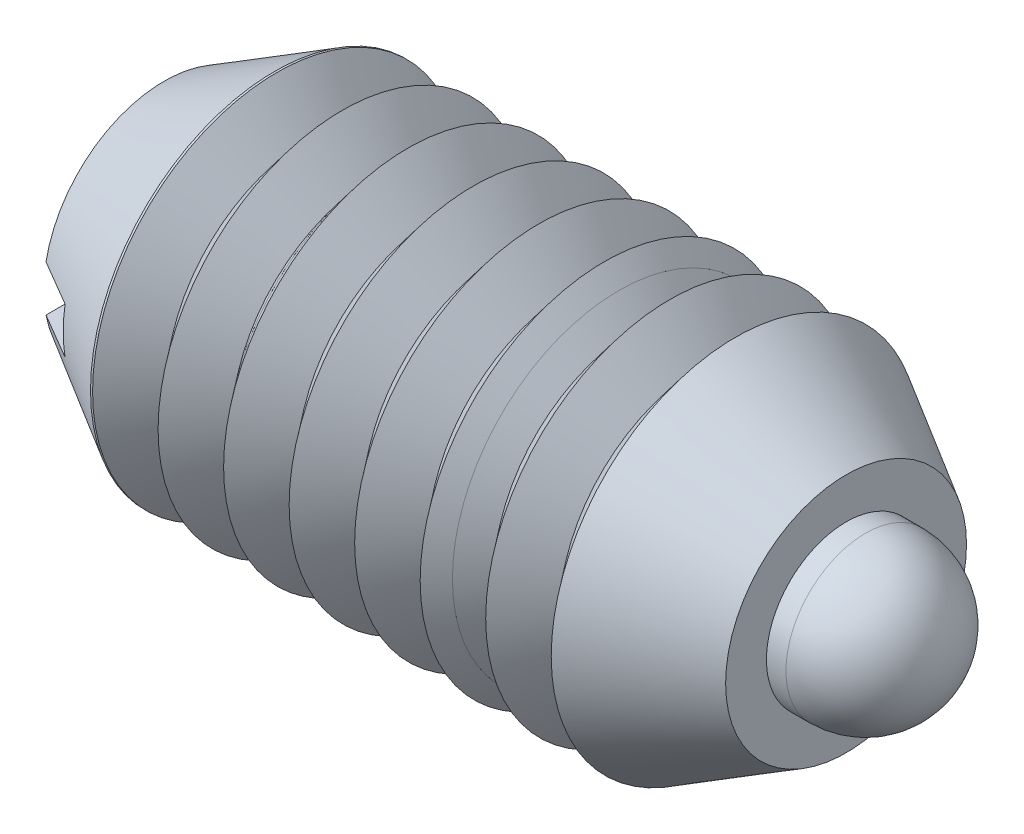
ISO-10303-21;
HEADER;
FILE_DESCRIPTION(('STEP AP214'),'2;1');
FILE_NAME('part.step','',(''),(''),'','','');
FILE_SCHEMA(('AUTOMOTIVE_DESIGN { 1 0 10303 214 1 1 1 1 }'));
ENDSEC;
DATA;
#1=APPLICATION_CONTEXT('core data for automotive mechanical design processes');
#2=APPLICATION_PROTOCOL_DEFINITION('international standard','automotive_design',2000,#1);
#3=PRODUCT_CONTEXT('',#1,'mechanical');
#4=PRODUCT('Part','Part','',(#3));
#5=PRODUCT_RELATED_PRODUCT_CATEGORY('part','',(#4));
#6=PRODUCT_DEFINITION_FORMATION('','',#4);
#7=PRODUCT_DEFINITION_CONTEXT('part definition',#1,'design');
#8=PRODUCT_DEFINITION('design','',#6,#7);
#9=PRODUCT_DEFINITION_SHAPE('','',#8);
#10=(LENGTH_UNIT() NAMED_UNIT(*) SI_UNIT(.MILLI.,.METRE.));
#11=(NAMED_UNIT(*) PLANE_ANGLE_UNIT() SI_UNIT($,.RADIAN.));
#12=(NAMED_UNIT(*) SI_UNIT($,.STERADIAN.) SOLID_ANGLE_UNIT());
#13=UNCERTAINTY_MEASURE_WITH_UNIT(LENGTH_MEASURE(1.E-05),#10,'distance_accuracy_value','');
#14=(GEOMETRIC_REPRESENTATION_CONTEXT(3) GLOBAL_UNCERTAINTY_ASSIGNED_CONTEXT((#13)) GLOBAL_UNIT_ASSIGNED_CONTEXT((#10,
#11,#12)) REPRESENTATION_CONTEXT('',''));
#15=CARTESIAN_POINT('',(0.,0.,0.));
#16=DIRECTION('',(0.,0.,1.));
#17=DIRECTION('',(1.,0.,0.));
#18=AXIS2_PLACEMENT_3D('',#15,#16,#17);
#19=CARTESIAN_POINT('',(10.741025,0.,0.));
#20=DIRECTION('',(-1.,0.,0.));
#21=DIRECTION('',(0.,-0.719424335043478,-0.694570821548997));
#22=AXIS2_PLACEMENT_3D('',#19,#20,#21);
#23=PLANE('',#22);
#24=CARTESIAN_POINT('',(10.741025,0.,0.));
#25=DIRECTION('',(1.,0.,0.));
#26=DIRECTION('',(0.,0.719424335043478,0.694570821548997));
#27=AXIS2_PLACEMENT_3D('',#24,#25,#26);
#28=CIRCLE('',#27,1.7145);
#29=CARTESIAN_POINT('',(10.741025,1.23345302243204,1.19084167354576));
#30=VERTEX_POINT('',#29);
#31=EDGE_CURVE('P0_E10',#30,#30,#28,.T.);
#32=ORIENTED_EDGE('',*,*,#31,.F.);
#33=EDGE_LOOP('',(#32));
#34=FACE_BOUND('',#33,.T.);
#35=ADVANCED_FACE('P0_F14',(#34),#23,.T.);
#36=CARTESIAN_POINT('',(11.083925,0.,0.));
#37=DIRECTION('',(1.,0.,0.));
#38=DIRECTION('',(0.,0.719424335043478,0.694570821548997));
#39=AXIS2_PLACEMENT_3D('',#36,#37,#38);
#40=CONICAL_SURFACE('',#39,2.0574,0.785398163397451);
#41=ORIENTED_EDGE('',*,*,#31,.T.);
#42=EDGE_LOOP('',(#41));
#43=FACE_BOUND('',#42,.T.);
#44=CARTESIAN_POINT('',(11.083925,0.,0.));
#45=DIRECTION('',(1.,0.,0.));
#46=DIRECTION('',(0.,0.719424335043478,0.694570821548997));
#47=AXIS2_PLACEMENT_3D('',#44,#45,#46);
#48=CIRCLE('',#47,2.0574);
#49=CARTESIAN_POINT('',(11.083925,1.48014362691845,1.42901000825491));
#50=VERTEX_POINT('',#49);
#51=EDGE_CURVE('P0_E20',#50,#50,#48,.T.);
#52=ORIENTED_EDGE('',*,*,#51,.F.);
#53=EDGE_LOOP('',(#52));
#54=FACE_BOUND('',#53,.T.);
#55=ADVANCED_FACE('P0_F54',(#43,#54),#40,.T.);
#56=CARTESIAN_POINT('',(16.817975,0.,0.));
#57=DIRECTION('',(1.,0.,0.));
#58=DIRECTION('',(0.,0.719424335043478,0.694570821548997));
#59=AXIS2_PLACEMENT_3D('',#56,#57,#58);
#60=CYLINDRICAL_SURFACE('',#59,2.0574);
#61=ORIENTED_EDGE('',*,*,#51,.T.);
#62=EDGE_LOOP('',(#61));
#63=FACE_BOUND('',#62,.T.);
#64=CARTESIAN_POINT('',(13.5761047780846,0.,0.));
#65=DIRECTION('',(1.,0.,0.));
#66=DIRECTION('',(0.,0.719424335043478,0.694570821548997));
#67=AXIS2_PLACEMENT_3D('',#64,#65,#66);
#68=CIRCLE('',#67,2.0574);
#69=CARTESIAN_POINT('',(13.5761047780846,1.48014362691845,1.42901000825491));
#70=VERTEX_POINT('',#69);
#71=EDGE_CURVE('P0_E24',#70,#70,#68,.T.);
#72=ORIENTED_EDGE('',*,*,#71,.F.);
#73=EDGE_LOOP('',(#72));
#74=FACE_BOUND('',#73,.T.);
#75=ADVANCED_FACE('P0_F50',(#63,#74),#60,.T.);
#76=CARTESIAN_POINT('',(14.170025,0.,0.));
#77=DIRECTION('',(-1.,0.,0.));
#78=DIRECTION('',(0.,-0.719424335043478,-0.694570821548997));
#79=AXIS2_PLACEMENT_3D('',#76,#77,#78);
#80=CONICAL_SURFACE('',#79,1.7145,0.5235987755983);
#81=ORIENTED_EDGE('',*,*,#71,.T.);
#82=EDGE_LOOP('',(#81));
#83=FACE_BOUND('',#82,.T.);
#84=CARTESIAN_POINT('',(14.170025,0.,0.));
#85=DIRECTION('',(1.,0.,0.));
#86=DIRECTION('',(0.,0.719424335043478,0.694570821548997));
#87=AXIS2_PLACEMENT_3D('',#84,#85,#86);
#88=CIRCLE('',#87,1.7145);
#89=CARTESIAN_POINT('',(14.170025,1.23345302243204,1.19084167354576));
#90=VERTEX_POINT('',#89);
#91=EDGE_CURVE('P0_E28',#90,#90,#88,.T.);
#92=ORIENTED_EDGE('',*,*,#91,.F.);
#93=EDGE_LOOP('',(#92));
#94=FACE_BOUND('',#93,.T.);
#95=ADVANCED_FACE('P0_F41',(#83,#94),#80,.T.);
#96=CARTESIAN_POINT('',(16.817975,0.,0.));
#97=DIRECTION('',(1.,0.,0.));
#98=DIRECTION('',(0.,0.719424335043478,0.694570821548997));
#99=AXIS2_PLACEMENT_3D('',#96,#97,#98);
#100=CYLINDRICAL_SURFACE('',#99,1.7145);
#101=ORIENTED_EDGE('',*,*,#91,.T.);
#102=EDGE_LOOP('',(#101));
#103=FACE_BOUND('',#102,.T.);
#104=CARTESIAN_POINT('',(15.103475,0.,0.));
#105=DIRECTION('',(1.,0.,0.));
#106=DIRECTION('',(0.,0.719424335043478,0.694570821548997));
#107=AXIS2_PLACEMENT_3D('',#104,#105,#106);
#108=CIRCLE('',#107,1.7145);
#109=CARTESIAN_POINT('',(15.103475,1.23345302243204,1.19084167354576));
#110=VERTEX_POINT('',#109);
#111=EDGE_CURVE('P0_E33',#110,#110,#108,.T.);
#112=ORIENTED_EDGE('',*,*,#111,.F.);
#113=EDGE_LOOP('',(#112));
#114=FACE_BOUND('',#113,.T.);
#115=ADVANCED_FACE('P0_F39',(#103,#114),#100,.T.);
#116=CARTESIAN_POINT('',(15.103475,0.,0.));
#117=DIRECTION('',(1.,0.,0.));
#118=DIRECTION('',(0.,0.719424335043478,0.694570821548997));
#119=AXIS2_PLACEMENT_3D('',#116,#117,#118);
#120=SPHERICAL_SURFACE('',#119,1.7145);
#121=ORIENTED_EDGE('',*,*,#111,.T.);
#122=EDGE_LOOP('',(#121));
#123=FACE_BOUND('',#122,.T.);
#124=ADVANCED_FACE('P0_F37',(#123),#120,.T.);
#125=CLOSED_SHELL('',(#35,#55,#75,#95,#115,#124));
#126=MANIFOLD_SOLID_BREP('P0_B1',#125);
#127=CARTESIAN_POINT('',(4.89479166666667,7.9375,-3.96875));
#128=DIRECTION('',(-1.,0.,0.));
#129=DIRECTION('',(0.,-1.,0.));
#130=AXIS2_PLACEMENT_3D('',#127,#128,#129);
#131=PLANE('',#130);
#132=CARTESIAN_POINT('',(4.89479166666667,0.,0.));
#133=DIRECTION('',(-1.,0.,0.));
#134=DIRECTION('',(0.,-1.,0.));
#135=AXIS2_PLACEMENT_3D('',#132,#133,#134);
#136=CIRCLE('',#135,3.52813069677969);
#137=CARTESIAN_POINT('',(4.89479166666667,-3.52813069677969,0.));
#138=VERTEX_POINT('',#137);
#139=EDGE_CURVE('P1_E31',#138,#138,#136,.F.);
#140=ORIENTED_EDGE('',*,*,#139,.F.);
#141=EDGE_LOOP('',(#140));
#142=FACE_BOUND('',#141,.T.);
#143=CARTESIAN_POINT('',(4.89479166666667,0.,0.));
#144=DIRECTION('',(1.,0.,0.));
#145=DIRECTION('',(0.,0.,-1.));
#146=AXIS2_PLACEMENT_3D('',#143,#144,#145);
#147=CIRCLE('',#146,2.0828);
#148=CARTESIAN_POINT('',(4.89479166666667,0.,-2.0828));
#149=VERTEX_POINT('',#148);
#150=EDGE_CURVE('P1_E47',#149,#149,#147,.T.);
#151=ORIENTED_EDGE('',*,*,#150,.T.);
#152=EDGE_LOOP('',(#151));
#153=FACE_BOUND('',#152,.T.);
#154=ADVANCED_FACE('P1_F14',(#142,#153),#131,.T.);
#155=CARTESIAN_POINT('',(9.78958333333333,7.9375,-3.96875));
#156=DIRECTION('',(1.,0.,0.));
#157=DIRECTION('',(0.,1.,0.));
#158=AXIS2_PLACEMENT_3D('',#155,#156,#157);
#159=PLANE('',#158);
#160=CARTESIAN_POINT('',(9.78958333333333,0.,0.));
#161=DIRECTION('',(1.,0.,0.));
#162=DIRECTION('',(0.,1.,0.));
#163=AXIS2_PLACEMENT_3D('',#160,#161,#162);
#164=CIRCLE('',#163,3.58320810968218);
#165=CARTESIAN_POINT('',(9.78958333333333,3.58320810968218,0.));
#166=VERTEX_POINT('',#165);
#167=EDGE_CURVE('P1_E33',#166,#166,#164,.F.);
#168=ORIENTED_EDGE('',*,*,#167,.F.);
#169=EDGE_LOOP('',(#168));
#170=FACE_BOUND('',#169,.T.);
#171=CARTESIAN_POINT('',(9.78958333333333,0.,0.));
#172=DIRECTION('',(1.,0.,0.));
#173=DIRECTION('',(0.,1.,0.));
#174=AXIS2_PLACEMENT_3D('',#171,#172,#173);
#175=CIRCLE('',#174,2.0828);
#176=CARTESIAN_POINT('',(9.78958333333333,2.0828,0.));
#177=VERTEX_POINT('',#176);
#178=EDGE_CURVE('P1_E18',#177,#177,#175,.F.);
#179=ORIENTED_EDGE('',*,*,#178,.T.);
#180=EDGE_LOOP('',(#179));
#181=FACE_BOUND('',#180,.T.);
#182=ADVANCED_FACE('P1_F76',(#170,#181),#159,.T.);
#183=CARTESIAN_POINT('',(6.65868055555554,0.,0.));
#184=DIRECTION('',(-1.,0.,0.));
#185=DIRECTION('',(0.,0.,1.));
#186=AXIS2_PLACEMENT_3D('',#183,#184,#185);
#187=CONICAL_SURFACE('',#186,3.96875,0.89566479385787);
#188=CARTESIAN_POINT('',(7.36423611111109,0.,0.));
#189=DIRECTION('',(-1.,0.,0.));
#190=DIRECTION('',(0.,0.,1.));
#191=AXIS2_PLACEMENT_3D('',#188,#189,#190);
#192=CIRCLE('',#191,3.08751139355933);
#193=CARTESIAN_POINT('',(7.36423611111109,0.,3.08751139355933));
#194=VERTEX_POINT('',#193);
#195=EDGE_CURVE('P1_E27',#194,#194,#192,.T.);
#196=ORIENTED_EDGE('',*,*,#195,.T.);
#197=EDGE_LOOP('',(#196));
#198=FACE_BOUND('',#197,.T.);
#199=CARTESIAN_POINT('',(6.65868055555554,0.,0.));
#200=DIRECTION('',(-1.,0.,0.));
#201=DIRECTION('',(0.,0.,1.));
#202=AXIS2_PLACEMENT_3D('',#199,#200,#201);
#203=CIRCLE('',#202,3.96875);
#204=CARTESIAN_POINT('',(6.65868055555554,0.,3.96875));
#205=VERTEX_POINT('',#204);
#206=EDGE_CURVE('P1_E39',#205,#205,#203,.T.);
#207=ORIENTED_EDGE('',*,*,#206,.F.);
#208=EDGE_LOOP('',(#207));
#209=FACE_BOUND('',#208,.T.);
#210=ADVANCED_FACE('P1_F56',(#198,#209),#187,.T.);
#211=CARTESIAN_POINT('',(5.95312499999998,0.,0.));
#212=DIRECTION('',(1.,0.,0.));
#213=DIRECTION('',(0.,0.,-1.));
#214=AXIS2_PLACEMENT_3D('',#211,#212,#213);
#215=CONICAL_SURFACE('',#214,3.08751139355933,0.895664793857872);
#216=ORIENTED_EDGE('',*,*,#206,.T.);
#217=EDGE_LOOP('',(#216));
#218=FACE_BOUND('',#217,.T.);
#219=CARTESIAN_POINT('',(5.95312499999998,0.,0.));
#220=DIRECTION('',(-1.,0.,0.));
#221=DIRECTION('',(0.,0.,1.));
#222=AXIS2_PLACEMENT_3D('',#219,#220,#221);
#223=CIRCLE('',#222,3.08751139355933);
#224=CARTESIAN_POINT('',(5.95312499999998,0.,3.08751139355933));
#225=VERTEX_POINT('',#224);
#226=EDGE_CURVE('P1_E44',#225,#225,#223,.T.);
#227=ORIENTED_EDGE('',*,*,#226,.F.);
#228=EDGE_LOOP('',(#227));
#229=FACE_BOUND('',#228,.T.);
#230=ADVANCED_FACE('P1_F90',(#218,#229),#215,.T.);
#231=CARTESIAN_POINT('',(5.24756944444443,0.,0.));
#232=DIRECTION('',(-1.,0.,0.));
#233=DIRECTION('',(0.,0.,1.));
#234=AXIS2_PLACEMENT_3D('',#231,#232,#233);
#235=CONICAL_SURFACE('',#234,3.96875,0.89566479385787);
#236=ORIENTED_EDGE('',*,*,#226,.T.);
#237=EDGE_LOOP('',(#236));
#238=FACE_BOUND('',#237,.T.);
#239=CARTESIAN_POINT('',(5.24756944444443,0.,0.));
#240=DIRECTION('',(-1.,0.,0.));
#241=DIRECTION('',(0.,0.,1.));
#242=AXIS2_PLACEMENT_3D('',#239,#240,#241);
#243=CIRCLE('',#242,3.96875);
#244=CARTESIAN_POINT('',(5.24756944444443,0.,3.96875));
#245=VERTEX_POINT('',#244);
#246=EDGE_CURVE('P1_E35',#245,#245,#243,.T.);
#247=ORIENTED_EDGE('',*,*,#246,.F.);
#248=EDGE_LOOP('',(#247));
#249=FACE_BOUND('',#248,.T.);
#250=ADVANCED_FACE('P1_F72',(#238,#249),#235,.T.);
#251=CARTESIAN_POINT('',(4.54201388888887,0.,0.));
#252=DIRECTION('',(1.,0.,0.));
#253=DIRECTION('',(0.,0.,-1.));
#254=AXIS2_PLACEMENT_3D('',#251,#252,#253);
#255=CONICAL_SURFACE('',#254,3.08751139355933,0.895664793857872);
#256=ORIENTED_EDGE('',*,*,#246,.T.);
#257=EDGE_LOOP('',(#256));
#258=FACE_BOUND('',#257,.T.);
#259=ORIENTED_EDGE('',*,*,#139,.T.);
#260=EDGE_LOOP('',(#259));
#261=FACE_BOUND('',#260,.T.);
#262=ADVANCED_FACE('P1_F62',(#258,#261),#255,.T.);
#263=CARTESIAN_POINT('',(7.36423611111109,0.,0.));
#264=DIRECTION('',(1.,0.,0.));
#265=DIRECTION('',(0.,0.,-1.));
#266=AXIS2_PLACEMENT_3D('',#263,#264,#265);
#267=CONICAL_SURFACE('',#266,3.08751139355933,0.895664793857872);
#268=CARTESIAN_POINT('',(8.06979166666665,0.,0.));
#269=DIRECTION('',(-1.,0.,0.));
#270=DIRECTION('',(0.,0.,1.));
#271=AXIS2_PLACEMENT_3D('',#268,#269,#270);
#272=CIRCLE('',#271,3.96875);
#273=CARTESIAN_POINT('',(8.06979166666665,0.,3.96875));
#274=VERTEX_POINT('',#273);
#275=EDGE_CURVE('P1_E51',#274,#274,#272,.T.);
#276=ORIENTED_EDGE('',*,*,#275,.T.);
#277=EDGE_LOOP('',(#276));
#278=FACE_BOUND('',#277,.T.);
#279=ORIENTED_EDGE('',*,*,#195,.F.);
#280=EDGE_LOOP('',(#279));
#281=FACE_BOUND('',#280,.T.);
#282=ADVANCED_FACE('P1_F59',(#278,#281),#267,.T.);
#283=CARTESIAN_POINT('',(8.06979166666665,0.,0.));
#284=DIRECTION('',(-1.,0.,0.));
#285=DIRECTION('',(0.,0.,1.));
#286=AXIS2_PLACEMENT_3D('',#283,#284,#285);
#287=CONICAL_SURFACE('',#286,3.96875,0.89566479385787);
#288=CARTESIAN_POINT('',(8.77534722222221,0.,0.));
#289=DIRECTION('',(-1.,0.,0.));
#290=DIRECTION('',(0.,0.,1.));
#291=AXIS2_PLACEMENT_3D('',#288,#289,#290);
#292=CIRCLE('',#291,3.08751139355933);
#293=CARTESIAN_POINT('',(8.77534722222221,0.,3.08751139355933));
#294=VERTEX_POINT('',#293);
#295=EDGE_CURVE('P1_E10',#294,#294,#292,.T.);
#296=ORIENTED_EDGE('',*,*,#295,.T.);
#297=EDGE_LOOP('',(#296));
#298=FACE_BOUND('',#297,.T.);
#299=ORIENTED_EDGE('',*,*,#275,.F.);
#300=EDGE_LOOP('',(#299));
#301=FACE_BOUND('',#300,.T.);
#302=ADVANCED_FACE('P1_F61',(#298,#301),#287,.T.);
#303=CARTESIAN_POINT('',(8.77534722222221,0.,0.));
#304=DIRECTION('',(1.,0.,0.));
#305=DIRECTION('',(0.,0.,-1.));
#306=AXIS2_PLACEMENT_3D('',#303,#304,#305);
#307=CONICAL_SURFACE('',#306,3.08751139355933,0.895664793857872);
#308=CARTESIAN_POINT('',(9.48090277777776,0.,0.));
#309=DIRECTION('',(-1.,0.,0.));
#310=DIRECTION('',(0.,0.,1.));
#311=AXIS2_PLACEMENT_3D('',#308,#309,#310);
#312=CIRCLE('',#311,3.96875);
#313=CARTESIAN_POINT('',(9.48090277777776,0.,3.96875));
#314=VERTEX_POINT('',#313);
#315=EDGE_CURVE('P1_E22',#314,#314,#312,.T.);
#316=ORIENTED_EDGE('',*,*,#315,.T.);
#317=EDGE_LOOP('',(#316));
#318=FACE_BOUND('',#317,.T.);
#319=ORIENTED_EDGE('',*,*,#295,.F.);
#320=EDGE_LOOP('',(#319));
#321=FACE_BOUND('',#320,.T.);
#322=ADVANCED_FACE('P1_F70',(#318,#321),#307,.T.);
#323=CARTESIAN_POINT('',(9.48090277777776,0.,0.));
#324=DIRECTION('',(-1.,0.,0.));
#325=DIRECTION('',(0.,0.,1.));
#326=AXIS2_PLACEMENT_3D('',#323,#324,#325);
#327=CONICAL_SURFACE('',#326,3.96875,0.89566479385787);
#328=ORIENTED_EDGE('',*,*,#315,.F.);
#329=EDGE_LOOP('',(#328));
#330=FACE_BOUND('',#329,.T.);
#331=ORIENTED_EDGE('',*,*,#167,.T.);
#332=EDGE_LOOP('',(#331));
#333=FACE_BOUND('',#332,.T.);
#334=ADVANCED_FACE('P1_F16',(#330,#333),#327,.T.);
#335=CARTESIAN_POINT('',(14.684375,0.,0.));
#336=DIRECTION('',(-1.,0.,0.));
#337=DIRECTION('',(0.,0.,1.));
#338=AXIS2_PLACEMENT_3D('',#335,#336,#337);
#339=CYLINDRICAL_SURFACE('',#338,2.0828);
#340=ORIENTED_EDGE('',*,*,#178,.F.);
#341=EDGE_LOOP('',(#340));
#342=FACE_BOUND('',#341,.T.);
#343=ORIENTED_EDGE('',*,*,#150,.F.);
#344=EDGE_LOOP('',(#343));
#345=FACE_BOUND('',#344,.T.);
#346=ADVANCED_FACE('P1_F147',(#342,#345),#339,.F.);
#347=CLOSED_SHELL('',(#154,#182,#210,#230,#250,#262,#282,#302,#322,#334,#346));
#348=MANIFOLD_SOLID_BREP('P1_B1',#347);
#349=CARTESIAN_POINT('',(14.684375,0.,0.));
#350=DIRECTION('',(1.,0.,0.));
#351=DIRECTION('',(0.,0.,-1.));
#352=AXIS2_PLACEMENT_3D('',#349,#350,#351);
#353=PLANE('',#352);
#354=CARTESIAN_POINT('',(14.684375,0.,0.));
#355=DIRECTION('',(1.,0.,0.));
#356=DIRECTION('',(0.,0.,-1.));
#357=AXIS2_PLACEMENT_3D('',#354,#355,#356);
#358=CIRCLE('',#357,2.5939346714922);
#359=CARTESIAN_POINT('',(14.684375,0.,-2.5939346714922));
#360=VERTEX_POINT('',#359);
#361=EDGE_CURVE('P2_E79',#360,#360,#358,.T.);
#362=ORIENTED_EDGE('',*,*,#361,.T.);
#363=EDGE_LOOP('',(#362));
#364=FACE_BOUND('',#363,.T.);
#365=CARTESIAN_POINT('',(14.684375,0.,0.));
#366=DIRECTION('',(-1.,0.,0.));
#367=DIRECTION('',(0.,0.,1.));
#368=AXIS2_PLACEMENT_3D('',#365,#366,#367);
#369=CIRCLE('',#368,1.7145);
#370=CARTESIAN_POINT('',(14.684375,0.,1.7145));
#371=VERTEX_POINT('',#370);
#372=EDGE_CURVE('P2_E66',#371,#371,#369,.T.);
#373=ORIENTED_EDGE('',*,*,#372,.T.);
#374=EDGE_LOOP('',(#373));
#375=FACE_BOUND('',#374,.T.);
#376=ADVANCED_FACE('P2_F15',(#364,#375),#353,.T.);
#377=CARTESIAN_POINT('',(14.684375,0.,0.));
#378=DIRECTION('',(-1.,0.,0.));
#379=DIRECTION('',(0.,0.,1.));
#380=AXIS2_PLACEMENT_3D('',#377,#378,#379);
#381=CONICAL_SURFACE('',#380,2.5939346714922,0.523598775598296);
#382=CARTESIAN_POINT('',(12.303125,0.,0.));
#383=DIRECTION('',(-1.,0.,0.));
#384=DIRECTION('',(0.,0.,1.));
#385=AXIS2_PLACEMENT_3D('',#382,#383,#384);
#386=CIRCLE('',#385,3.96875);
#387=CARTESIAN_POINT('',(12.303125,0.,3.96875));
#388=VERTEX_POINT('',#387);
#389=EDGE_CURVE('P2_E142',#388,#388,#386,.T.);
#390=ORIENTED_EDGE('',*,*,#389,.F.);
#391=EDGE_LOOP('',(#390));
#392=FACE_BOUND('',#391,.T.);
#393=ORIENTED_EDGE('',*,*,#361,.F.);
#394=EDGE_LOOP('',(#393));
#395=FACE_BOUND('',#394,.T.);
#396=ADVANCED_FACE('P2_F17',(#392,#395),#381,.T.);
#397=CARTESIAN_POINT('',(0.,0.,0.));
#398=DIRECTION('',(-1.,0.,0.));
#399=DIRECTION('',(0.,0.,1.));
#400=AXIS2_PLACEMENT_3D('',#397,#398,#399);
#401=CYLINDRICAL_SURFACE('',#400,1.7145);
#402=CARTESIAN_POINT('',(14.170025,0.,0.));
#403=DIRECTION('',(-1.,0.,0.));
#404=DIRECTION('',(0.,0.,1.));
#405=AXIS2_PLACEMENT_3D('',#402,#403,#404);
#406=CIRCLE('',#405,1.7145);
#407=CARTESIAN_POINT('',(14.170025,0.,1.7145));
#408=VERTEX_POINT('',#407);
#409=EDGE_CURVE('P2_E154',#408,#408,#406,.T.);
#410=ORIENTED_EDGE('',*,*,#409,.T.);
#411=EDGE_LOOP('',(#410));
#412=FACE_BOUND('',#411,.T.);
#413=ORIENTED_EDGE('',*,*,#372,.F.);
#414=EDGE_LOOP('',(#413));
#415=FACE_BOUND('',#414,.T.);
#416=ADVANCED_FACE('P2_F180',(#412,#415),#401,.F.);
#417=CARTESIAN_POINT('',(14.170025,0.,0.));
#418=DIRECTION('',(-1.,0.,0.));
#419=DIRECTION('',(0.,0.,1.));
#420=AXIS2_PLACEMENT_3D('',#417,#418,#419);
#421=CONICAL_SURFACE('',#420,1.7145,0.785398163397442);
#422=CARTESIAN_POINT('',(13.827125,0.,0.));
#423=DIRECTION('',(-1.,0.,0.));
#424=DIRECTION('',(0.,0.,1.));
#425=AXIS2_PLACEMENT_3D('',#422,#423,#424);
#426=CIRCLE('',#425,2.0574);
#427=CARTESIAN_POINT('',(13.827125,0.,2.0574));
#428=VERTEX_POINT('',#427);
#429=EDGE_CURVE('P2_E151',#428,#428,#426,.T.);
#430=ORIENTED_EDGE('',*,*,#429,.T.);
#431=EDGE_LOOP('',(#430));
#432=FACE_BOUND('',#431,.T.);
#433=ORIENTED_EDGE('',*,*,#409,.F.);
#434=EDGE_LOOP('',(#433));
#435=FACE_BOUND('',#434,.T.);
#436=ADVANCED_FACE('P2_F187',(#432,#435),#421,.F.);
#437=CARTESIAN_POINT('',(0.,0.,0.));
#438=DIRECTION('',(-1.,0.,0.));
#439=DIRECTION('',(0.,0.,1.));
#440=AXIS2_PLACEMENT_3D('',#437,#438,#439);
#441=CYLINDRICAL_SURFACE('',#440,2.0574);
#442=CARTESIAN_POINT('',(2.9765625,0.,0.));
#443=DIRECTION('',(-1.,0.,0.));
#444=DIRECTION('',(0.,0.,1.));
#445=AXIS2_PLACEMENT_3D('',#442,#443,#444);
#446=CIRCLE('',#445,2.0574);
#447=CARTESIAN_POINT('',(2.9765625,0.,2.0574));
#448=VERTEX_POINT('',#447);
#449=EDGE_CURVE('P2_E148',#448,#448,#446,.T.);
#450=ORIENTED_EDGE('',*,*,#449,.T.);
#451=EDGE_LOOP('',(#450));
#452=FACE_BOUND('',#451,.T.);
#453=ORIENTED_EDGE('',*,*,#429,.F.);
#454=EDGE_LOOP('',(#453));
#455=FACE_BOUND('',#454,.T.);
#456=ADVANCED_FACE('P2_F192',(#452,#455),#441,.F.);
#457=CARTESIAN_POINT('',(2.9765625,0.,0.));
#458=DIRECTION('',(1.,0.,0.));
#459=DIRECTION('',(0.,0.,-1.));
#460=AXIS2_PLACEMENT_3D('',#457,#458,#459);
#461=PLANE('',#460);
#462=ORIENTED_EDGE('',*,*,#449,.F.);
#463=EDGE_LOOP('',(#462));
#464=FACE_BOUND('',#463,.T.);
#465=ADVANCED_FACE('P2_F198',(#464),#461,.T.);
#466=CARTESIAN_POINT('',(11.5975694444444,0.,0.));
#467=DIRECTION('',(1.,0.,0.));
#468=DIRECTION('',(0.,0.,-1.));
#469=AXIS2_PLACEMENT_3D('',#466,#467,#468);
#470=CONICAL_SURFACE('',#469,3.08751139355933,0.895664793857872);
#471=ORIENTED_EDGE('',*,*,#389,.T.);
#472=EDGE_LOOP('',(#471));
#473=FACE_BOUND('',#472,.T.);
#474=CARTESIAN_POINT('',(11.5975694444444,0.,0.));
#475=DIRECTION('',(-1.,0.,0.));
#476=DIRECTION('',(0.,0.,1.));
#477=AXIS2_PLACEMENT_3D('',#474,#475,#476);
#478=CIRCLE('',#477,3.08751139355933);
#479=CARTESIAN_POINT('',(11.5975694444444,0.,3.08751139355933));
#480=VERTEX_POINT('',#479);
#481=EDGE_CURVE('P2_E145',#480,#480,#478,.T.);
#482=ORIENTED_EDGE('',*,*,#481,.F.);
#483=EDGE_LOOP('',(#482));
#484=FACE_BOUND('',#483,.T.);
#485=ADVANCED_FACE('P2_F202',(#473,#484),#470,.T.);
#486=CARTESIAN_POINT('',(10.8920138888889,0.,0.));
#487=DIRECTION('',(-1.,0.,0.));
#488=DIRECTION('',(0.,0.,1.));
#489=AXIS2_PLACEMENT_3D('',#486,#487,#488);
#490=CONICAL_SURFACE('',#489,3.96875,0.89566479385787);
#491=ORIENTED_EDGE('',*,*,#481,.T.);
#492=EDGE_LOOP('',(#491));
#493=FACE_BOUND('',#492,.T.);
#494=CARTESIAN_POINT('',(10.8920138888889,0.,0.));
#495=DIRECTION('',(-1.,0.,0.));
#496=DIRECTION('',(0.,0.,1.));
#497=AXIS2_PLACEMENT_3D('',#494,#495,#496);
#498=CIRCLE('',#497,3.96875);
#499=CARTESIAN_POINT('',(10.8920138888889,0.,3.96875));
#500=VERTEX_POINT('',#499);
#501=EDGE_CURVE('P2_E136',#500,#500,#498,.T.);
#502=ORIENTED_EDGE('',*,*,#501,.F.);
#503=EDGE_LOOP('',(#502));
#504=FACE_BOUND('',#503,.T.);
#505=ADVANCED_FACE('P2_F206',(#493,#504),#490,.T.);
#506=CARTESIAN_POINT('',(10.1864583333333,0.,0.));
#507=DIRECTION('',(1.,0.,0.));
#508=DIRECTION('',(0.,0.,-1.));
#509=AXIS2_PLACEMENT_3D('',#506,#507,#508);
#510=CONICAL_SURFACE('',#509,3.08751139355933,0.895664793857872);
#511=ORIENTED_EDGE('',*,*,#501,.T.);
#512=EDGE_LOOP('',(#511));
#513=FACE_BOUND('',#512,.T.);
#514=CARTESIAN_POINT('',(10.1864583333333,0.,0.));
#515=DIRECTION('',(-1.,0.,0.));
#516=DIRECTION('',(0.,0.,1.));
#517=AXIS2_PLACEMENT_3D('',#514,#515,#516);
#518=CIRCLE('',#517,3.08751139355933);
#519=CARTESIAN_POINT('',(10.1864583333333,0.,3.08751139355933));
#520=VERTEX_POINT('',#519);
#521=EDGE_CURVE('P2_E139',#520,#520,#518,.T.);
#522=ORIENTED_EDGE('',*,*,#521,.F.);
#523=EDGE_LOOP('',(#522));
#524=FACE_BOUND('',#523,.T.);
#525=ADVANCED_FACE('P2_F210',(#513,#524),#510,.T.);
#526=CARTESIAN_POINT('',(9.48090277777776,0.,0.));
#527=DIRECTION('',(-1.,0.,0.));
#528=DIRECTION('',(0.,0.,1.));
#529=AXIS2_PLACEMENT_3D('',#526,#527,#528);
#530=CONICAL_SURFACE('',#529,3.96875,0.89566479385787);
#531=CARTESIAN_POINT('',(9.78958333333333,0.,0.));
#532=DIRECTION('',(1.,0.,0.));
#533=DIRECTION('',(0.,0.,-1.));
#534=AXIS2_PLACEMENT_3D('',#531,#532,#533);
#535=CIRCLE('',#534,3.58320810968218);
#536=CARTESIAN_POINT('',(9.78958333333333,0.,-3.58320810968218));
#537=VERTEX_POINT('',#536);
#538=EDGE_CURVE('P2_E19',#537,#537,#535,.F.);
#539=ORIENTED_EDGE('',*,*,#538,.F.);
#540=EDGE_LOOP('',(#539));
#541=FACE_BOUND('',#540,.T.);
#542=ORIENTED_EDGE('',*,*,#521,.T.);
#543=EDGE_LOOP('',(#542));
#544=FACE_BOUND('',#543,.T.);
#545=ADVANCED_FACE('P2_F214',(#541,#544),#530,.T.);
#546=CARTESIAN_POINT('',(4.89479166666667,0.,0.));
#547=DIRECTION('',(1.,0.,0.));
#548=DIRECTION('',(0.,0.,-1.));
#549=AXIS2_PLACEMENT_3D('',#546,#547,#548);
#550=PLANE('',#549);
#551=CARTESIAN_POINT('',(4.89479166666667,0.,0.));
#552=DIRECTION('',(1.,0.,0.));
#553=DIRECTION('',(0.,0.,-1.));
#554=AXIS2_PLACEMENT_3D('',#551,#552,#553);
#555=CIRCLE('',#554,3.52813069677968);
#556=CARTESIAN_POINT('',(4.89479166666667,0.,-3.52813069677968));
#557=VERTEX_POINT('',#556);
#558=EDGE_CURVE('P2_E110',#557,#557,#555,.F.);
#559=ORIENTED_EDGE('',*,*,#558,.F.);
#560=EDGE_LOOP('',(#559));
#561=FACE_BOUND('',#560,.T.);
#562=CARTESIAN_POINT('',(4.89479166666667,0.,0.));
#563=DIRECTION('',(1.,0.,0.));
#564=DIRECTION('',(0.,0.,-1.));
#565=AXIS2_PLACEMENT_3D('',#562,#563,#564);
#566=CIRCLE('',#565,2.0828);
#567=CARTESIAN_POINT('',(4.89479166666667,0.,-2.0828));
#568=VERTEX_POINT('',#567);
#569=EDGE_CURVE('P2_E112',#568,#568,#566,.T.);
#570=ORIENTED_EDGE('',*,*,#569,.F.);
#571=EDGE_LOOP('',(#570));
#572=FACE_BOUND('',#571,.T.);
#573=ADVANCED_FACE('P2_F218',(#561,#572),#550,.T.);
#574=CARTESIAN_POINT('',(21.1563248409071,0.,0.));
#575=DIRECTION('',(-1.,0.,0.));
#576=DIRECTION('',(0.,0.,1.));
#577=AXIS2_PLACEMENT_3D('',#574,#575,#576);
#578=CYLINDRICAL_SURFACE('',#577,2.0828);
#579=ORIENTED_EDGE('',*,*,#569,.T.);
#580=EDGE_LOOP('',(#579));
#581=FACE_BOUND('',#580,.T.);
#582=CARTESIAN_POINT('',(9.78958333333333,0.,0.));
#583=DIRECTION('',(1.,0.,0.));
#584=DIRECTION('',(0.,0.,-1.));
#585=AXIS2_PLACEMENT_3D('',#582,#583,#584);
#586=CIRCLE('',#585,2.0828);
#587=CARTESIAN_POINT('',(9.78958333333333,0.,-2.0828));
#588=VERTEX_POINT('',#587);
#589=EDGE_CURVE('P2_E118',#588,#588,#586,.T.);
#590=ORIENTED_EDGE('',*,*,#589,.F.);
#591=EDGE_LOOP('',(#590));
#592=FACE_BOUND('',#591,.T.);
#593=ADVANCED_FACE('P2_F171',(#581,#592),#578,.T.);
#594=CARTESIAN_POINT('',(9.78958333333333,0.,0.));
#595=DIRECTION('',(1.,0.,0.));
#596=DIRECTION('',(0.,0.,-1.));
#597=AXIS2_PLACEMENT_3D('',#594,#595,#596);
#598=PLANE('',#597);
#599=ORIENTED_EDGE('',*,*,#538,.T.);
#600=EDGE_LOOP('',(#599));
#601=FACE_BOUND('',#600,.T.);
#602=ORIENTED_EDGE('',*,*,#589,.T.);
#603=EDGE_LOOP('',(#602));
#604=FACE_BOUND('',#603,.T.);
#605=ADVANCED_FACE('P2_F166',(#601,#604),#598,.F.);
#606=CARTESIAN_POINT('',(0.,0.,0.));
#607=DIRECTION('',(1.,0.,0.));
#608=DIRECTION('',(0.,0.,-1.));
#609=AXIS2_PLACEMENT_3D('',#606,#607,#608);
#610=PLANE('',#609);
#611=CARTESIAN_POINT('',(0.,0.,0.));
#612=DIRECTION('',(1.,0.,0.));
#613=DIRECTION('',(0.,0.,-1.));
#614=AXIS2_PLACEMENT_3D('',#611,#612,#613);
#615=CIRCLE('',#614,2.5939346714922);
#616=CARTESIAN_POINT('',(0.,-0.49609375,-2.5460534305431));
#617=VERTEX_POINT('',#616);
#618=CARTESIAN_POINT('',(0.,-0.49609375,2.5460534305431));
#619=VERTEX_POINT('',#618);
#620=EDGE_CURVE('P2_E75',#617,#619,#615,.F.);
#621=ORIENTED_EDGE('',*,*,#620,.T.);
#622=DIRECTION('',(0.,0.,1.));
#623=VECTOR('',#622,1.);
#624=CARTESIAN_POINT('',(0.,-0.49609375,-3.96875));
#625=LINE('',#624,#623);
#626=EDGE_CURVE('P2_E33',#617,#619,#625,.T.);
#627=ORIENTED_EDGE('',*,*,#626,.F.);
#628=EDGE_LOOP('',(#621,#627));
#629=FACE_BOUND('',#628,.T.);
#630=ADVANCED_FACE('P2_F101',(#629),#610,.F.);
#631=CARTESIAN_POINT('',(0.,-0.49609375,-3.96875));
#632=DIRECTION('',(0.,-1.,0.));
#633=DIRECTION('',(0.,0.,-1.));
#634=AXIS2_PLACEMENT_3D('',#631,#632,#633);
#635=PLANE('',#634);
#636=CARTESIAN_POINT('',(5.79195031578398,-0.49609375,-5.91715894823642));
#637=CARTESIAN_POINT('',(5.50277108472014,-0.49609375,-5.74961309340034));
#638=CARTESIAN_POINT('',(5.21361142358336,-0.49609375,-5.58203343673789));
#639=CARTESIAN_POINT('',(4.63534852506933,-0.49609375,-5.24677609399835));
#640=CARTESIAN_POINT('',(4.34624528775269,-0.49609375,-5.07909840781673));
#641=CARTESIAN_POINT('',(3.76805625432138,-0.49609375,-4.74358192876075));
#642=CARTESIAN_POINT('',(3.47897047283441,-0.49609375,-4.57574311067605));
#643=CARTESIAN_POINT('',(2.90090210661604,-0.49609375,-4.23988840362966));
#644=CARTESIAN_POINT('',(2.61191952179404,-0.49609375,-4.07187251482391));
#645=CARTESIAN_POINT('',(2.04163523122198,-0.49609375,-3.73997081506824));
#646=CARTESIAN_POINT('',(1.76032972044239,-0.49609375,-3.57609154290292));
#647=CARTESIAN_POINT('',(1.19792631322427,-0.49609375,-3.24797522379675));
#648=CARTESIAN_POINT('',(0.916828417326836,-0.49609375,-3.08373817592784));
#649=CARTESIAN_POINT('',(0.355013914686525,-0.49609375,-2.7547236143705));
#650=CARTESIAN_POINT('',(0.074297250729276,-0.49609375,-2.58994619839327));
#651=CARTESIAN_POINT('',(-0.486572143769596,-0.49609375,-2.25943551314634));
#652=CARTESIAN_POINT('',(-0.766724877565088,-0.49609375,-2.09370224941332));
#653=CARTESIAN_POINT('',(-1.18687015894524,-0.49609375,-1.84321237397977));
#654=CARTESIAN_POINT('',(-1.32728734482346,-0.49609375,-1.75916900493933));
#655=CARTESIAN_POINT('',(-1.60772111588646,-0.49609375,-1.59030830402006));
#656=CARTESIAN_POINT('',(-1.74773754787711,-0.49609375,-1.50549071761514));
#657=CARTESIAN_POINT('',(-2.02850231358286,-0.49609375,-1.33379801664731));
#658=CARTESIAN_POINT('',(-2.16924322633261,-0.49609375,-1.24691069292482));
#659=CARTESIAN_POINT('',(-2.3792690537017,-0.49609375,-1.11499964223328));
#660=CARTESIAN_POINT('',(-2.44906317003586,-0.49609375,-1.07078776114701));
#661=CARTESIAN_POINT('',(-2.58815620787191,-0.49609375,-0.981594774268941));
#662=CARTESIAN_POINT('',(-2.65745514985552,-0.49609375,-0.936613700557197));
#663=CARTESIAN_POINT('',(-2.79536618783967,-0.49609375,-0.84548183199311));
#664=CARTESIAN_POINT('',(-2.86397764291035,-0.49609375,-0.799330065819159));
#665=CARTESIAN_POINT('',(-3.00019503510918,-0.49609375,-0.705144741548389));
#666=CARTESIAN_POINT('',(-3.06779769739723,-0.49609375,-0.657106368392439));
#667=CARTESIAN_POINT('',(-3.16718437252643,-0.49609375,-0.583010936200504));
#668=CARTESIAN_POINT('',(-3.19982047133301,-0.49609375,-0.558100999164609));
#669=CARTESIAN_POINT('',(-3.26427750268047,-0.49609375,-0.50725232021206));
#670=CARTESIAN_POINT('',(-3.29609862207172,-0.49609375,-0.481313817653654));
#671=CARTESIAN_POINT('',(-3.35837630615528,-0.49609375,-0.428097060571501));
#672=CARTESIAN_POINT('',(-3.38883802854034,-0.49609375,-0.4008248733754));
#673=CARTESIAN_POINT('',(-3.44774560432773,-0.49609375,-0.344201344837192));
#674=CARTESIAN_POINT('',(-3.47619467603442,-0.49609375,-0.314853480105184));
#675=CARTESIAN_POINT('',(-3.51236741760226,-0.49609375,-0.272791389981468));
#676=CARTESIAN_POINT('',(-3.5216929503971,-0.49609375,-0.261465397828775));
#677=CARTESIAN_POINT('',(-3.539723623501,-0.49609375,-0.238327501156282));
#678=CARTESIAN_POINT('',(-3.54842847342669,-0.49609375,-0.226515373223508));
#679=CARTESIAN_POINT('',(-3.5733044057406,-0.49609375,-0.190322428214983));
#680=CARTESIAN_POINT('',(-3.58832504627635,-0.49609375,-0.165087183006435));
#681=CARTESIAN_POINT('',(-3.60827262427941,-0.49609375,-0.122261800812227));
#682=CARTESIAN_POINT('',(-3.61486054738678,-0.49609375,-0.105457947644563));
#683=CARTESIAN_POINT('',(-3.62530354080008,-0.49609375,-0.071011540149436));
#684=CARTESIAN_POINT('',(-3.62916226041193,-0.49609375,-0.053370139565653));
#685=CARTESIAN_POINT('',(-3.6335928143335,-0.49609375,-0.0175056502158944));
#686=CARTESIAN_POINT('',(-3.6341361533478,-0.49609375,0.000721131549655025));
#687=CARTESIAN_POINT('',(-3.63176024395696,-0.49609375,0.0369425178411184));
#688=CARTESIAN_POINT('',(-3.62883947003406,-0.49609375,0.0549370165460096));
#689=CARTESIAN_POINT('',(-3.61909302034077,-0.49609375,0.0938433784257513));
#690=CARTESIAN_POINT('',(-3.61157744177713,-0.49609375,0.114576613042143));
#691=CARTESIAN_POINT('',(-3.59342326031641,-0.49609375,0.154629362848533));
#692=CARTESIAN_POINT('',(-3.58277520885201,-0.49609375,0.173944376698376));
#693=CARTESIAN_POINT('',(-3.55594062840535,-0.49609375,0.216760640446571));
#694=CARTESIAN_POINT('',(-3.53904762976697,-0.49609375,0.239808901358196));
#695=CARTESIAN_POINT('',(-3.50313314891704,-0.49609375,0.284206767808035));
#696=CARTESIAN_POINT('',(-3.48410699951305,-0.49609375,0.305552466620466));
#697=CARTESIAN_POINT('',(-3.44457317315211,-0.49609375,0.347090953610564));
#698=CARTESIAN_POINT('',(-3.42405616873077,-0.49609375,0.367274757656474));
#699=CARTESIAN_POINT('',(-3.382126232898,-0.49609375,0.406629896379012));
#700=CARTESIAN_POINT('',(-3.36071431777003,-0.49609375,0.425802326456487));
#701=CARTESIAN_POINT('',(-3.2907490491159,-0.49609375,0.486347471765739));
#702=CARTESIAN_POINT('',(-3.24094932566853,-0.49609375,0.526271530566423));
#703=CARTESIAN_POINT('',(-3.13972167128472,-0.49609375,0.604012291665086));
#704=CARTESIAN_POINT('',(-3.08829268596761,-0.49609375,0.641827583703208));
#705=CARTESIAN_POINT('',(-2.98434500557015,-0.49609375,0.716155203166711));
#706=CARTESIAN_POINT('',(-2.93182430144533,-0.49609375,0.752664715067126));
#707=CARTESIAN_POINT('',(-2.82616042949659,-0.49609375,0.824731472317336));
#708=CARTESIAN_POINT('',(-2.773017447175,-0.49609375,0.860288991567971));
#709=CARTESIAN_POINT('',(-2.6664016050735,-0.49609375,0.93065760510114));
#710=CARTESIAN_POINT('',(-2.61292967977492,-0.49609375,0.965470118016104));
#711=CARTESIAN_POINT('',(-2.50566261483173,-0.49609375,1.03460093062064));
#712=CARTESIAN_POINT('',(-2.45186745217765,-0.49609375,1.0689191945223));
#713=CARTESIAN_POINT('',(-2.29025977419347,-0.49609375,1.17123054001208));
#714=CARTESIAN_POINT('',(-2.18209427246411,-0.49609375,1.23866553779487));
#715=CARTESIAN_POINT('',(-1.96583716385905,-0.49609375,1.37222479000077));
#716=CARTESIAN_POINT('',(-1.85774886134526,-0.49609375,1.43835441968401));
#717=CARTESIAN_POINT('',(-1.64119983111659,-0.49609375,1.57000167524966));
#718=CARTESIAN_POINT('',(-1.53273910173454,-0.49609375,1.63551929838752));
#719=CARTESIAN_POINT('',(-1.2069712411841,-0.49609375,1.83144622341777));
#720=CARTESIAN_POINT('',(-0.989285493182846,-0.49609375,1.96122526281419));
#721=CARTESIAN_POINT('',(-0.553265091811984,-0.49609375,2.21994162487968));
#722=CARTESIAN_POINT('',(-0.334930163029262,-0.49609375,2.34887848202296));
#723=CARTESIAN_POINT('',(0.102067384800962,-0.49609375,2.60618739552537));
#724=CARTESIAN_POINT('',(0.320729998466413,-0.49609375,2.73455946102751));
#725=CARTESIAN_POINT('',(0.758134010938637,-0.49609375,2.99085756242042));
#726=CARTESIAN_POINT('',(0.97687527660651,-0.49609375,3.11878382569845));
#727=CARTESIAN_POINT('',(1.41450717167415,-0.49609375,3.37438268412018));
#728=CARTESIAN_POINT('',(1.63339780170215,-0.49609375,3.502055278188));
#729=CARTESIAN_POINT('',(2.29016069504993,-0.49609375,3.88476586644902));
#730=CARTESIAN_POINT('',(2.72818957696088,-0.49609375,4.13953504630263));
#731=CARTESIAN_POINT('',(3.38501577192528,-0.49609375,4.52115962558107));
#732=CARTESIAN_POINT('',(3.6037254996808,-0.49609375,4.6481658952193));
#733=CARTESIAN_POINT('',(4.04120019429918,-0.49609375,4.90210197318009));
#734=CARTESIAN_POINT('',(4.25996516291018,-0.49609375,5.02903177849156));
#735=CARTESIAN_POINT('',(4.69758712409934,-0.49609375,5.28285970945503));
#736=CARTESIAN_POINT('',(4.91644412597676,-0.49609375,5.40975781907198));
#737=CARTESIAN_POINT('',(5.35418025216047,-0.49609375,5.6634970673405));
#738=CARTESIAN_POINT('',(5.57305937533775,-0.49609375,5.79033820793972));
#739=CARTESIAN_POINT('',(5.79195031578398,-0.49609375,5.91715894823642));
#740=B_SPLINE_CURVE_WITH_KNOTS('',3,(#636,#637,#638,#639,#640,#641,#642,#643,#644,#645,#646,
#647,#648,#649,#650,#651,#652,#653,#654,#655,#656,#657,#658,#659,#660,#661,#662,#663,#664,#665,
#666,#667,#668,#669,#670,#671,#672,#673,#674,#675,#676,#677,#678,#679,#680,#681,#682,#683,#684,
#685,#686,#687,#688,#689,#690,#691,#692,#693,#694,#695,#696,#697,#698,#699,#700,#701,#702,#703,
#704,#705,#706,#707,#708,#709,#710,#711,#712,#713,#714,#715,#716,#717,#718,#719,#720,#721,#722,
#723,#724,#725,#726,#727,#728,#729,#730,#731,#732,#733,#734,#735,#736,#737,#738,#739),
.UNSPECIFIED.,.F.,.F.,(4,2,2,2,2,2,2,2,2,2,2,2,2,2,2,2,2,2,2,2,2,2,2,2,2,2,2,2,2,2,2,2,2,2,2,2,
2,2,2,2,2,2,2,2,2,2,2,2,2,2,2,4),(0.,1.00262964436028,2.00526035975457,3.0080883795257,
4.01091551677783,4.98759488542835,5.96427679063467,6.94079088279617,7.9172993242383,
8.40823801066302,8.89934436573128,9.39553304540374,9.64338721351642,9.89123106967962,
10.1392877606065,10.3880249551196,10.5111808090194,10.6343081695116,10.7569197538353,
10.8793306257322,10.9233232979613,10.9673364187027,11.0549692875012,11.1089442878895,
11.1628469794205,11.2172123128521,11.2716015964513,11.3373858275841,11.4033705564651,
11.488885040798,11.5745904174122,11.6608879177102,11.7470899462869,11.9384470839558,
12.1299306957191,12.3218049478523,12.5136233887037,12.7050364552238,12.8964633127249,
13.2788485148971,13.6589855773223,14.0391243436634,14.7994266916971,15.5601187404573,
16.320798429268,17.0810059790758,17.8412167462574,19.3614102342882,20.120146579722,
20.8789110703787,21.6378667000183,22.3967940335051),.UNSPECIFIED.);
#741=CARTESIAN_POINT('',(0.9921875,-0.49609375,-3.12767502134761));
#742=VERTEX_POINT('',#741);
#743=EDGE_CURVE('P2_E92',#742,#617,#740,.T.);
#744=ORIENTED_EDGE('',*,*,#743,.T.);
#745=ORIENTED_EDGE('',*,*,#626,.T.);
#746=CARTESIAN_POINT('',(0.9921875,-0.49609375,3.12767502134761));
#747=VERTEX_POINT('',#746);
#748=EDGE_CURVE('P2_E86',#619,#747,#740,.T.);
#749=ORIENTED_EDGE('',*,*,#748,.T.);
#750=DIRECTION('',(0.,0.,1.));
#751=VECTOR('',#750,1.);
#752=CARTESIAN_POINT('',(0.9921875,-0.49609375,-3.96875));
#753=LINE('',#752,#751);
#754=EDGE_CURVE('P2_E160',#742,#747,#753,.T.);
#755=ORIENTED_EDGE('',*,*,#754,.F.);
#756=EDGE_LOOP('',(#744,#745,#749,#755));
#757=FACE_BOUND('',#756,.T.);
#758=ADVANCED_FACE('P2_F95',(#757),#635,.F.);
#759=CARTESIAN_POINT('',(0.9921875,0.49609375,-3.96875));
#760=DIRECTION('',(1.,0.,0.));
#761=DIRECTION('',(0.,0.,-1.));
#762=AXIS2_PLACEMENT_3D('',#759,#760,#761);
#763=PLANE('',#762);
#764=CARTESIAN_POINT('',(0.9921875,0.,0.));
#765=DIRECTION('',(1.,0.,0.));
#766=DIRECTION('',(0.,0.,-1.));
#767=AXIS2_PLACEMENT_3D('',#764,#765,#766);
#768=CIRCLE('',#767,3.16677439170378);
#769=CARTESIAN_POINT('',(0.9921875,0.49609375,3.12767502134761));
#770=VERTEX_POINT('',#769);
#771=EDGE_CURVE('P2_E41',#747,#770,#768,.F.);
#772=ORIENTED_EDGE('',*,*,#771,.T.);
#773=DIRECTION('',(0.,0.,1.));
#774=VECTOR('',#773,1.);
#775=CARTESIAN_POINT('',(0.9921875,0.49609375,-3.96875));
#776=LINE('',#775,#774);
#777=CARTESIAN_POINT('',(0.9921875,0.49609375,-3.12767502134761));
#778=VERTEX_POINT('',#777);
#779=EDGE_CURVE('P2_E81',#778,#770,#776,.T.);
#780=ORIENTED_EDGE('',*,*,#779,.F.);
#781=EDGE_CURVE('P2_E24',#778,#742,#768,.F.);
#782=ORIENTED_EDGE('',*,*,#781,.T.);
#783=ORIENTED_EDGE('',*,*,#754,.T.);
#784=EDGE_LOOP('',(#772,#780,#782,#783));
#785=FACE_BOUND('',#784,.T.);
#786=ADVANCED_FACE('P2_F100',(#785),#763,.F.);
#787=CARTESIAN_POINT('',(0.,0.49609375,2.5460534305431));
#788=VERTEX_POINT('',#787);
#789=CARTESIAN_POINT('',(0.,0.49609375,-2.5460534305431));
#790=VERTEX_POINT('',#789);
#791=EDGE_CURVE('P2_E72',#788,#790,#615,.F.);
#792=ORIENTED_EDGE('',*,*,#791,.T.);
#793=DIRECTION('',(0.,0.,1.));
#794=VECTOR('',#793,1.);
#795=CARTESIAN_POINT('',(0.,0.49609375,-3.96875));
#796=LINE('',#795,#794);
#797=EDGE_CURVE('P2_E59',#790,#788,#796,.T.);
#798=ORIENTED_EDGE('',*,*,#797,.T.);
#799=EDGE_LOOP('',(#792,#798));
#800=FACE_BOUND('',#799,.T.);
#801=ADVANCED_FACE('P2_F74',(#800),#610,.F.);
#802=CARTESIAN_POINT('',(0.,0.49609375,-3.96875));
#803=DIRECTION('',(0.,1.,0.));
#804=DIRECTION('',(0.,0.,1.));
#805=AXIS2_PLACEMENT_3D('',#802,#803,#804);
#806=PLANE('',#805);
#807=CARTESIAN_POINT('',(5.79195031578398,0.49609375,5.91715894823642));
#808=CARTESIAN_POINT('',(5.50277108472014,0.49609375,5.74961309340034));
#809=CARTESIAN_POINT('',(5.21361142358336,0.49609375,5.58203343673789));
#810=CARTESIAN_POINT('',(4.63534852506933,0.49609375,5.24677609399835));
#811=CARTESIAN_POINT('',(4.34624528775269,0.49609375,5.07909840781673));
#812=CARTESIAN_POINT('',(3.76805625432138,0.49609375,4.74358192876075));
#813=CARTESIAN_POINT('',(3.47897047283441,0.49609375,4.57574311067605));
#814=CARTESIAN_POINT('',(2.90090210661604,0.49609375,4.23988840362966));
#815=CARTESIAN_POINT('',(2.61191952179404,0.49609375,4.07187251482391));
#816=CARTESIAN_POINT('',(2.04163523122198,0.49609375,3.73997081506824));
#817=CARTESIAN_POINT('',(1.76032972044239,0.49609375,3.57609154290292));
#818=CARTESIAN_POINT('',(1.19792631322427,0.49609375,3.24797522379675));
#819=CARTESIAN_POINT('',(0.916828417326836,0.49609375,3.08373817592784));
#820=CARTESIAN_POINT('',(0.355013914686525,0.49609375,2.7547236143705));
#821=CARTESIAN_POINT('',(0.074297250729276,0.49609375,2.58994619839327));
#822=CARTESIAN_POINT('',(-0.486572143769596,0.49609375,2.25943551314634));
#823=CARTESIAN_POINT('',(-0.766724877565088,0.49609375,2.09370224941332));
#824=CARTESIAN_POINT('',(-1.18687015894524,0.49609375,1.84321237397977));
#825=CARTESIAN_POINT('',(-1.32728734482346,0.49609375,1.75916900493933));
#826=CARTESIAN_POINT('',(-1.60772111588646,0.49609375,1.59030830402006));
#827=CARTESIAN_POINT('',(-1.74773754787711,0.49609375,1.50549071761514));
#828=CARTESIAN_POINT('',(-2.02850231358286,0.49609375,1.33379801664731));
#829=CARTESIAN_POINT('',(-2.16924322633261,0.49609375,1.24691069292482));
#830=CARTESIAN_POINT('',(-2.3792690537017,0.49609375,1.11499964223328));
#831=CARTESIAN_POINT('',(-2.44906317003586,0.49609375,1.07078776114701));
#832=CARTESIAN_POINT('',(-2.58815620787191,0.49609375,0.981594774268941));
#833=CARTESIAN_POINT('',(-2.65745514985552,0.49609375,0.936613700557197));
#834=CARTESIAN_POINT('',(-2.79536618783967,0.49609375,0.84548183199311));
#835=CARTESIAN_POINT('',(-2.86397764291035,0.49609375,0.799330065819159));
#836=CARTESIAN_POINT('',(-3.00019503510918,0.49609375,0.705144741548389));
#837=CARTESIAN_POINT('',(-3.06779769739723,0.49609375,0.657106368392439));
#838=CARTESIAN_POINT('',(-3.16718437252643,0.49609375,0.583010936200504));
#839=CARTESIAN_POINT('',(-3.19982047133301,0.49609375,0.558100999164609));
#840=CARTESIAN_POINT('',(-3.26427750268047,0.49609375,0.50725232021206));
#841=CARTESIAN_POINT('',(-3.29609862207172,0.49609375,0.481313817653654));
#842=CARTESIAN_POINT('',(-3.35837630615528,0.49609375,0.428097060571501));
#843=CARTESIAN_POINT('',(-3.38883802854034,0.49609375,0.4008248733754));
#844=CARTESIAN_POINT('',(-3.44774560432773,0.49609375,0.344201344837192));
#845=CARTESIAN_POINT('',(-3.47619467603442,0.49609375,0.314853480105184));
#846=CARTESIAN_POINT('',(-3.51236741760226,0.49609375,0.272791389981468));
#847=CARTESIAN_POINT('',(-3.5216929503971,0.49609375,0.261465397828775));
#848=CARTESIAN_POINT('',(-3.539723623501,0.49609375,0.238327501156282));
#849=CARTESIAN_POINT('',(-3.54842847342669,0.49609375,0.226515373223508));
#850=CARTESIAN_POINT('',(-3.5733044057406,0.49609375,0.190322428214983));
#851=CARTESIAN_POINT('',(-3.58832504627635,0.49609375,0.165087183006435));
#852=CARTESIAN_POINT('',(-3.60827262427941,0.49609375,0.122261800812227));
#853=CARTESIAN_POINT('',(-3.61486054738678,0.49609375,0.105457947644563));
#854=CARTESIAN_POINT('',(-3.62530354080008,0.49609375,0.071011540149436));
#855=CARTESIAN_POINT('',(-3.62916226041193,0.49609375,0.053370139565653));
#856=CARTESIAN_POINT('',(-3.6335928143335,0.49609375,0.0175056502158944));
#857=CARTESIAN_POINT('',(-3.6341361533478,0.49609375,-0.000721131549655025));
#858=CARTESIAN_POINT('',(-3.63176024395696,0.49609375,-0.0369425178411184));
#859=CARTESIAN_POINT('',(-3.62883947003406,0.49609375,-0.0549370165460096));
#860=CARTESIAN_POINT('',(-3.61909302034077,0.49609375,-0.0938433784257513));
#861=CARTESIAN_POINT('',(-3.61157744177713,0.49609375,-0.114576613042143));
#862=CARTESIAN_POINT('',(-3.59342326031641,0.49609375,-0.154629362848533));
#863=CARTESIAN_POINT('',(-3.58277520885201,0.49609375,-0.173944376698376));
#864=CARTESIAN_POINT('',(-3.55594062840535,0.49609375,-0.216760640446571));
#865=CARTESIAN_POINT('',(-3.53904762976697,0.49609375,-0.239808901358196));
#866=CARTESIAN_POINT('',(-3.50313314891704,0.49609375,-0.284206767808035));
#867=CARTESIAN_POINT('',(-3.48410699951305,0.49609375,-0.305552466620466));
#868=CARTESIAN_POINT('',(-3.44457317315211,0.49609375,-0.347090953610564));
#869=CARTESIAN_POINT('',(-3.42405616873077,0.49609375,-0.367274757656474));
#870=CARTESIAN_POINT('',(-3.382126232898,0.49609375,-0.406629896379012));
#871=CARTESIAN_POINT('',(-3.36071431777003,0.49609375,-0.425802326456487));
#872=CARTESIAN_POINT('',(-3.2907490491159,0.49609375,-0.486347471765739));
#873=CARTESIAN_POINT('',(-3.24094932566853,0.49609375,-0.526271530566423));
#874=CARTESIAN_POINT('',(-3.13972167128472,0.49609375,-0.604012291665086));
#875=CARTESIAN_POINT('',(-3.08829268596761,0.49609375,-0.641827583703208));
#876=CARTESIAN_POINT('',(-2.98434500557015,0.49609375,-0.716155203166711));
#877=CARTESIAN_POINT('',(-2.93182430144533,0.49609375,-0.752664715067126));
#878=CARTESIAN_POINT('',(-2.82616042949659,0.49609375,-0.824731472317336));
#879=CARTESIAN_POINT('',(-2.773017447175,0.49609375,-0.860288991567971));
#880=CARTESIAN_POINT('',(-2.6664016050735,0.49609375,-0.93065760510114));
#881=CARTESIAN_POINT('',(-2.61292967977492,0.49609375,-0.965470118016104));
#882=CARTESIAN_POINT('',(-2.50566261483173,0.49609375,-1.03460093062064));
#883=CARTESIAN_POINT('',(-2.45186745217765,0.49609375,-1.0689191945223));
#884=CARTESIAN_POINT('',(-2.29025977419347,0.49609375,-1.17123054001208));
#885=CARTESIAN_POINT('',(-2.18209427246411,0.49609375,-1.23866553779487));
#886=CARTESIAN_POINT('',(-1.96583716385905,0.49609375,-1.37222479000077));
#887=CARTESIAN_POINT('',(-1.85774886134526,0.49609375,-1.43835441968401));
#888=CARTESIAN_POINT('',(-1.64119983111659,0.49609375,-1.57000167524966));
#889=CARTESIAN_POINT('',(-1.53273910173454,0.49609375,-1.63551929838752));
#890=CARTESIAN_POINT('',(-1.2069712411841,0.49609375,-1.83144622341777));
#891=CARTESIAN_POINT('',(-0.989285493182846,0.49609375,-1.96122526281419));
#892=CARTESIAN_POINT('',(-0.553265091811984,0.49609375,-2.21994162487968));
#893=CARTESIAN_POINT('',(-0.334930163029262,0.49609375,-2.34887848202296));
#894=CARTESIAN_POINT('',(0.102067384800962,0.49609375,-2.60618739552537));
#895=CARTESIAN_POINT('',(0.320729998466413,0.49609375,-2.73455946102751));
#896=CARTESIAN_POINT('',(0.758134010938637,0.49609375,-2.99085756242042));
#897=CARTESIAN_POINT('',(0.97687527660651,0.49609375,-3.11878382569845));
#898=CARTESIAN_POINT('',(1.41450717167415,0.49609375,-3.37438268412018));
#899=CARTESIAN_POINT('',(1.63339780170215,0.49609375,-3.502055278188));
#900=CARTESIAN_POINT('',(2.29016069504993,0.49609375,-3.88476586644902));
#901=CARTESIAN_POINT('',(2.72818957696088,0.49609375,-4.13953504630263));
#902=CARTESIAN_POINT('',(3.38501577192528,0.49609375,-4.52115962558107));
#903=CARTESIAN_POINT('',(3.6037254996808,0.49609375,-4.6481658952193));
#904=CARTESIAN_POINT('',(4.04120019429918,0.49609375,-4.90210197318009));
#905=CARTESIAN_POINT('',(4.25996516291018,0.49609375,-5.02903177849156));
#906=CARTESIAN_POINT('',(4.69758712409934,0.49609375,-5.28285970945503));
#907=CARTESIAN_POINT('',(4.91644412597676,0.49609375,-5.40975781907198));
#908=CARTESIAN_POINT('',(5.35418025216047,0.49609375,-5.6634970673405));
#909=CARTESIAN_POINT('',(5.57305937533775,0.49609375,-5.79033820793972));
#910=CARTESIAN_POINT('',(5.79195031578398,0.49609375,-5.91715894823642));
#911=B_SPLINE_CURVE_WITH_KNOTS('',3,(#807,#808,#809,#810,#811,#812,#813,#814,#815,#816,#817,
#818,#819,#820,#821,#822,#823,#824,#825,#826,#827,#828,#829,#830,#831,#832,#833,#834,#835,#836,
#837,#838,#839,#840,#841,#842,#843,#844,#845,#846,#847,#848,#849,#850,#851,#852,#853,#854,#855,
#856,#857,#858,#859,#860,#861,#862,#863,#864,#865,#866,#867,#868,#869,#870,#871,#872,#873,#874,
#875,#876,#877,#878,#879,#880,#881,#882,#883,#884,#885,#886,#887,#888,#889,#890,#891,#892,#893,
#894,#895,#896,#897,#898,#899,#900,#901,#902,#903,#904,#905,#906,#907,#908,#909,#910),
.UNSPECIFIED.,.F.,.F.,(4,2,2,2,2,2,2,2,2,2,2,2,2,2,2,2,2,2,2,2,2,2,2,2,2,2,2,2,2,2,2,2,2,2,2,2,
2,2,2,2,2,2,2,2,2,2,2,2,2,2,2,4),(0.,1.00262964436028,2.00526035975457,3.0080883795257,
4.01091551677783,4.98759488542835,5.96427679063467,6.94079088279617,7.9172993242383,
8.40823801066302,8.89934436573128,9.39553304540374,9.64338721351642,9.89123106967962,
10.1392877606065,10.3880249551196,10.5111808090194,10.6343081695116,10.7569197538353,
10.8793306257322,10.9233232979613,10.9673364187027,11.0549692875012,11.1089442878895,
11.1628469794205,11.2172123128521,11.2716015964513,11.3373858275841,11.4033705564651,
11.488885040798,11.5745904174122,11.6608879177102,11.7470899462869,11.9384470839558,
12.1299306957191,12.3218049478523,12.5136233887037,12.7050364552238,12.8964633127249,
13.2788485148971,13.6589855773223,14.0391243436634,14.7994266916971,15.5601187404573,
16.320798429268,17.0810059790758,17.8412167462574,19.3614102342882,20.120146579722,
20.8789110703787,21.6378667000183,22.3967940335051),.UNSPECIFIED.);
#912=EDGE_CURVE('P2_E26',#770,#788,#911,.T.);
#913=ORIENTED_EDGE('',*,*,#912,.T.);
#914=ORIENTED_EDGE('',*,*,#797,.F.);
#915=EDGE_CURVE('P2_E10',#790,#778,#911,.T.);
#916=ORIENTED_EDGE('',*,*,#915,.T.);
#917=ORIENTED_EDGE('',*,*,#779,.T.);
#918=EDGE_LOOP('',(#913,#914,#916,#917));
#919=FACE_BOUND('',#918,.T.);
#920=ADVANCED_FACE('P2_F61',(#919),#806,.F.);
#921=CARTESIAN_POINT('',(2.38125000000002,0.,0.));
#922=DIRECTION('',(1.,0.,0.));
#923=DIRECTION('',(0.,0.,-1.));
#924=AXIS2_PLACEMENT_3D('',#921,#922,#923);
#925=CONICAL_SURFACE('',#924,3.96875,0.523598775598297);
#926=ORIENTED_EDGE('',*,*,#915,.F.);
#927=ORIENTED_EDGE('',*,*,#791,.F.);
#928=ORIENTED_EDGE('',*,*,#912,.F.);
#929=ORIENTED_EDGE('',*,*,#771,.F.);
#930=ORIENTED_EDGE('',*,*,#748,.F.);
#931=ORIENTED_EDGE('',*,*,#620,.F.);
#932=ORIENTED_EDGE('',*,*,#743,.F.);
#933=ORIENTED_EDGE('',*,*,#781,.F.);
#934=EDGE_LOOP('',(#926,#927,#928,#929,#930,#931,#932,#933));
#935=FACE_BOUND('',#934,.T.);
#936=CARTESIAN_POINT('',(2.38125000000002,0.,0.));
#937=DIRECTION('',(1.,0.,0.));
#938=DIRECTION('',(0.,0.,-1.));
#939=AXIS2_PLACEMENT_3D('',#936,#937,#938);
#940=CIRCLE('',#939,3.96875);
#941=CARTESIAN_POINT('',(2.38125000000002,0.,-3.96875));
#942=VERTEX_POINT('',#941);
#943=EDGE_CURVE('P2_E76',#942,#942,#940,.T.);
#944=ORIENTED_EDGE('',*,*,#943,.F.);
#945=EDGE_LOOP('',(#944));
#946=FACE_BOUND('',#945,.T.);
#947=ADVANCED_FACE('P2_F70',(#935,#946),#925,.T.);
#948=CARTESIAN_POINT('',(14.684375,0.,0.));
#949=DIRECTION('',(-1.,0.,0.));
#950=DIRECTION('',(0.,0.,1.));
#951=AXIS2_PLACEMENT_3D('',#948,#949,#950);
#952=CYLINDRICAL_SURFACE('',#951,3.96875);
#953=ORIENTED_EDGE('',*,*,#943,.T.);
#954=EDGE_LOOP('',(#953));
#955=FACE_BOUND('',#954,.T.);
#956=CARTESIAN_POINT('',(2.42534722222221,0.,0.));
#957=DIRECTION('',(-1.,0.,0.));
#958=DIRECTION('',(0.,0.,1.));
#959=AXIS2_PLACEMENT_3D('',#956,#957,#958);
#960=CIRCLE('',#959,3.96875);
#961=CARTESIAN_POINT('',(2.42534722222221,0.,3.96875));
#962=VERTEX_POINT('',#961);
#963=EDGE_CURVE('P2_E127',#962,#962,#960,.T.);
#964=ORIENTED_EDGE('',*,*,#963,.T.);
#965=EDGE_LOOP('',(#964));
#966=FACE_BOUND('',#965,.T.);
#967=ADVANCED_FACE('P2_F235',(#955,#966),#952,.T.);
#968=CARTESIAN_POINT('',(2.42534722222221,0.,0.));
#969=DIRECTION('',(-1.,0.,0.));
#970=DIRECTION('',(0.,0.,1.));
#971=AXIS2_PLACEMENT_3D('',#968,#969,#970);
#972=CONICAL_SURFACE('',#971,3.96875,0.89566479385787);
#973=CARTESIAN_POINT('',(3.13090277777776,0.,0.));
#974=DIRECTION('',(-1.,0.,0.));
#975=DIRECTION('',(0.,0.,1.));
#976=AXIS2_PLACEMENT_3D('',#973,#974,#975);
#977=CIRCLE('',#976,3.08751139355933);
#978=CARTESIAN_POINT('',(3.13090277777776,0.,3.08751139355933));
#979=VERTEX_POINT('',#978);
#980=EDGE_CURVE('P2_E130',#979,#979,#977,.T.);
#981=ORIENTED_EDGE('',*,*,#980,.T.);
#982=EDGE_LOOP('',(#981));
#983=FACE_BOUND('',#982,.T.);
#984=ORIENTED_EDGE('',*,*,#963,.F.);
#985=EDGE_LOOP('',(#984));
#986=FACE_BOUND('',#985,.T.);
#987=ADVANCED_FACE('P2_F231',(#983,#986),#972,.T.);
#988=CARTESIAN_POINT('',(3.13090277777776,0.,0.));
#989=DIRECTION('',(1.,0.,0.));
#990=DIRECTION('',(0.,0.,-1.));
#991=AXIS2_PLACEMENT_3D('',#988,#989,#990);
#992=CONICAL_SURFACE('',#991,3.08751139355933,0.895664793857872);
#993=CARTESIAN_POINT('',(3.83645833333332,0.,0.));
#994=DIRECTION('',(-1.,0.,0.));
#995=DIRECTION('',(0.,0.,1.));
#996=AXIS2_PLACEMENT_3D('',#993,#994,#995);
#997=CIRCLE('',#996,3.96875);
#998=CARTESIAN_POINT('',(3.83645833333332,0.,3.96875));
#999=VERTEX_POINT('',#998);
#1000=EDGE_CURVE('P2_E116',#999,#999,#997,.T.);
#1001=ORIENTED_EDGE('',*,*,#1000,.T.);
#1002=EDGE_LOOP('',(#1001));
#1003=FACE_BOUND('',#1002,.T.);
#1004=ORIENTED_EDGE('',*,*,#980,.F.);
#1005=EDGE_LOOP('',(#1004));
#1006=FACE_BOUND('',#1005,.T.);
#1007=ADVANCED_FACE('P2_F227',(#1003,#1006),#992,.T.);
#1008=CARTESIAN_POINT('',(3.83645833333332,0.,0.));
#1009=DIRECTION('',(-1.,0.,0.));
#1010=DIRECTION('',(0.,0.,1.));
#1011=AXIS2_PLACEMENT_3D('',#1008,#1009,#1010);
#1012=CONICAL_SURFACE('',#1011,3.96875,0.89566479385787);
#1013=CARTESIAN_POINT('',(4.54201388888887,0.,0.));
#1014=DIRECTION('',(-1.,0.,0.));
#1015=DIRECTION('',(0.,0.,1.));
#1016=AXIS2_PLACEMENT_3D('',#1013,#1014,#1015);
#1017=CIRCLE('',#1016,3.08751139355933);
#1018=CARTESIAN_POINT('',(4.54201388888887,0.,3.08751139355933));
#1019=VERTEX_POINT('',#1018);
#1020=EDGE_CURVE('P2_E133',#1019,#1019,#1017,.T.);
#1021=ORIENTED_EDGE('',*,*,#1020,.T.);
#1022=EDGE_LOOP('',(#1021));
#1023=FACE_BOUND('',#1022,.T.);
#1024=ORIENTED_EDGE('',*,*,#1000,.F.);
#1025=EDGE_LOOP('',(#1024));
#1026=FACE_BOUND('',#1025,.T.);
#1027=ADVANCED_FACE('P2_F223',(#1023,#1026),#1012,.T.);
#1028=CARTESIAN_POINT('',(4.54201388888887,0.,0.));
#1029=DIRECTION('',(1.,0.,0.));
#1030=DIRECTION('',(0.,0.,-1.));
#1031=AXIS2_PLACEMENT_3D('',#1028,#1029,#1030);
#1032=CONICAL_SURFACE('',#1031,3.08751139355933,0.895664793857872);
#1033=ORIENTED_EDGE('',*,*,#1020,.F.);
#1034=EDGE_LOOP('',(#1033));
#1035=FACE_BOUND('',#1034,.T.);
#1036=ORIENTED_EDGE('',*,*,#558,.T.);
#1037=EDGE_LOOP('',(#1036));
#1038=FACE_BOUND('',#1037,.T.);
#1039=ADVANCED_FACE('P2_F220',(#1035,#1038),#1032,.T.);
#1040=CLOSED_SHELL('',(#376,#396,#416,#436,#456,#465,#485,#505,#525,#545,#573,#593,#605,#630,
#758,#786,#801,#920,#947,#967,#987,#1007,#1027,#1039));
#1041=MANIFOLD_SOLID_BREP('P2_B1',#1040);
#1042=ADVANCED_BREP_SHAPE_REPRESENTATION('',(#18,#126,#348,#1041),#14);
#1043=SHAPE_DEFINITION_REPRESENTATION(#9,#1042);
ENDSEC;
END-ISO-10303-21;
